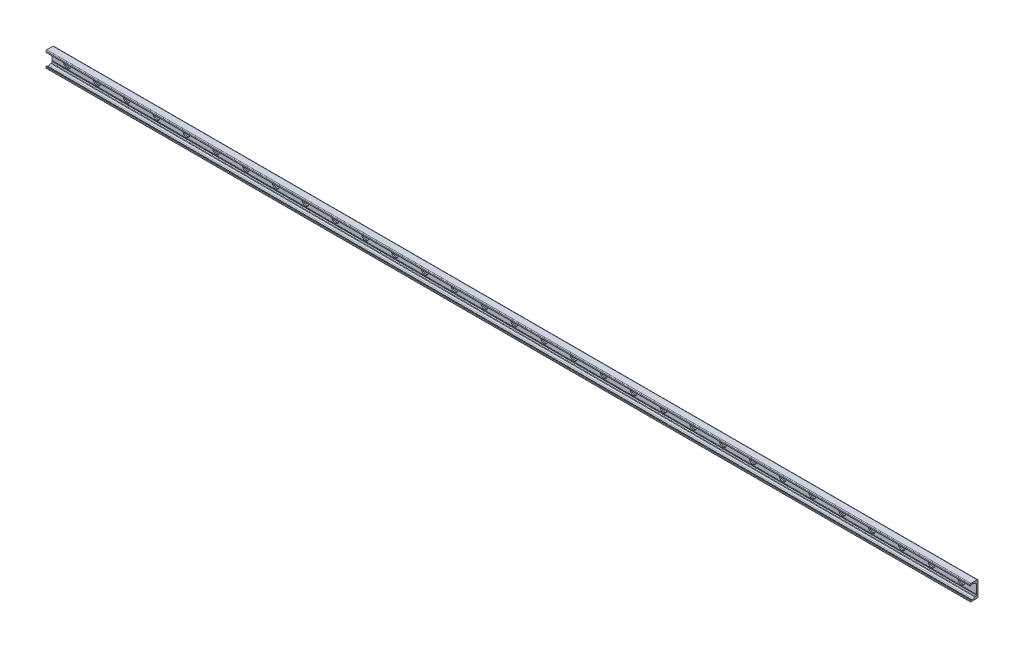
from build123d import *

# Parameters (mm, degrees)
BOSS_EXTRUDE1_DEPTH = 1240
SKETCH2_R           = 9
SKETCH2_R_2         = 4.5
CUT_EXTRUDE1_DEPTH  = 3.1
SKETCH2_2_R         = 4.5
CUT_EXTRUDE2_DEPTH  = 1241.296133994
LPATTERN1_COUNT     = 31
LPATTERN1_PITCH     = 80


with BuildPart() as part:
    # Sketch1 → Boss-Extrude1 (new, symmetric)
    with BuildSketch(Plane(origin=(0, 0, 0), x_dir=(0, 0, -1), z_dir=(1, 0, 0))):
        with BuildLine():
            Line((0, 0), (0, 19))
            ThreePointArc((0, 19), (-0.732233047, 20.767766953), (-2.5, 21.5))
            Line((-2.5, 21.5), (-19, 21.5))
            ThreePointArc((-19, 21.5), (-20.414213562, 20.914213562), (-21, 19.5))
            Line((-21, 19.5), (-21, 16.625057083))
            ThreePointArc((-21, 16.625057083), (-20.553251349, 15.888838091), (-19.693931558, 15.945160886))
            Line((-19.693931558, 15.945160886), (-16.794305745, 17.975500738))
            ThreePointArc((-16.794305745, 17.975500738), (-14.5, 18.69889256), (-12.205694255, 17.975500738))
            Line((-12.205694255, 17.975500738), (-8.829831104, 15.611695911))
            ThreePointArc((-8.829831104, 15.611695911), (-8.28408983, 15.342566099), (-7.682678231, 15.25))
            Line((-7.682678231, 15.25), (-6.5, 15.25))
            ThreePointArc((-6.5, 15.25), (-5.085786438, 14.664213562), (-4.5, 13.25))
            Line((-4.5, 13.25), (-4.5, -10.75))
            ThreePointArc((-4.5, -10.75), (-4.25, -11), (-4.5, -11.25))
            Line((-4.5, -11.25), (-4.5, -12.25))
            ThreePointArc((-4.5, -12.25), (-4.25, -12.5), (-4.5, -12.75))
            Line((-4.5, -12.75), (-4.5, -13.25))
            ThreePointArc((-4.5, -13.25), (-5.085786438, -14.664213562), (-6.5, -15.25))
            Line((-6.5, -15.25), (-7.682678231, -15.25))
            ThreePointArc((-7.682678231, -15.25), (-8.28408983, -15.342566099), (-8.829831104, -15.611695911))
            Line((-8.829831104, -15.611695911), (-12.205694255, -17.975500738))
            ThreePointArc((-12.205694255, -17.975500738), (-14.5, -18.69889256), (-16.794305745, -17.975500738))
            Line((-16.794305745, -17.975500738), (-19.693931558, -15.945160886))
            ThreePointArc((-19.693931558, -15.945160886), (-20.553251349, -15.888838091), (-21, -16.625057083))
            Line((-21, -16.625057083), (-21, -19.5))
            ThreePointArc((-21, -19.5), (-20.414213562, -20.914213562), (-19, -21.5))
            Line((-19, -21.5), (-2.5, -21.5))
            ThreePointArc((-2.5, -21.5), (-0.732233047, -20.767766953), (0, -19))
            Line((0, -19), (0, 0))
        make_face()
    extrude(amount=BOSS_EXTRUDE1_DEPTH, both=True)

    # Sketch2 → Cut-Extrude1 (cut)
    with BuildSketch(Plane.XY.offset(4.5)):
        with Locations((1200, 0)):
            Circle(SKETCH2_R)
        with Locations((1200, 0)):
            Circle(SKETCH2_R_2, mode=Mode.SUBTRACT)
    cut_extrude1 = extrude(amount=-CUT_EXTRUDE1_DEPTH, mode=Mode.SUBTRACT)

    # Sketch2_2 → Cut-Extrude2 (cut, through all)
    with BuildSketch(Plane.XY.offset(4.5)):
        with Locations((1200, 0)):
            Circle(SKETCH2_2_R)
    cut_extrude2 = extrude(amount=-CUT_EXTRUDE2_DEPTH, mode=Mode.SUBTRACT)

    # LPattern1: Cut-Extrude1, Cut-Extrude2 ×31
    with Locations(*[(-i * LPATTERN1_PITCH, 0, 0) for i in range(1, LPATTERN1_COUNT)]):
        add(cut_extrude1, mode=Mode.SUBTRACT)
        add(cut_extrude2, mode=Mode.SUBTRACT)


solid = part.part
